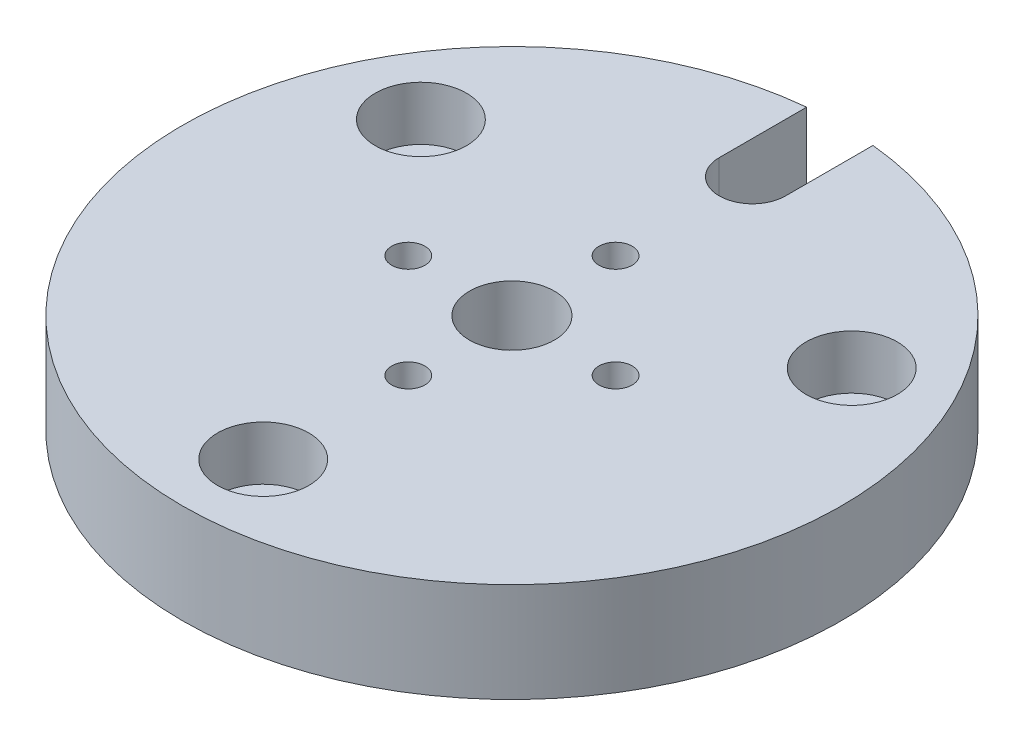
ISO-10303-21;
HEADER;
FILE_DESCRIPTION(('STEP AP214'),'2;1');
FILE_NAME('part.step','',(''),(''),'','','');
FILE_SCHEMA(('AUTOMOTIVE_DESIGN { 1 0 10303 214 1 1 1 1 }'));
ENDSEC;
DATA;
#1=APPLICATION_CONTEXT('core data for automotive mechanical design processes');
#2=APPLICATION_PROTOCOL_DEFINITION('international standard','automotive_design',2000,#1);
#3=PRODUCT_CONTEXT('',#1,'mechanical');
#4=PRODUCT('Part','Part','',(#3));
#5=PRODUCT_RELATED_PRODUCT_CATEGORY('part','',(#4));
#6=PRODUCT_DEFINITION_FORMATION('','',#4);
#7=PRODUCT_DEFINITION_CONTEXT('part definition',#1,'design');
#8=PRODUCT_DEFINITION('design','',#6,#7);
#9=PRODUCT_DEFINITION_SHAPE('','',#8);
#10=(LENGTH_UNIT() NAMED_UNIT(*) SI_UNIT(.MILLI.,.METRE.));
#11=(NAMED_UNIT(*) PLANE_ANGLE_UNIT() SI_UNIT($,.RADIAN.));
#12=(NAMED_UNIT(*) SI_UNIT($,.STERADIAN.) SOLID_ANGLE_UNIT());
#13=UNCERTAINTY_MEASURE_WITH_UNIT(LENGTH_MEASURE(1.E-05),#10,'distance_accuracy_value','');
#14=(GEOMETRIC_REPRESENTATION_CONTEXT(3) GLOBAL_UNCERTAINTY_ASSIGNED_CONTEXT((#13)) GLOBAL_UNIT_ASSIGNED_CONTEXT((#10,
#11,#12)) REPRESENTATION_CONTEXT('',''));
#15=CARTESIAN_POINT('',(0.,0.,0.));
#16=DIRECTION('',(0.,0.,1.));
#17=DIRECTION('',(1.,0.,0.));
#18=AXIS2_PLACEMENT_3D('',#15,#16,#17);
#19=CARTESIAN_POINT('',(0.,26.9919886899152,0.));
#20=DIRECTION('',(0.,1.,0.));
#21=DIRECTION('',(0.,0.,1.));
#22=AXIS2_PLACEMENT_3D('',#19,#20,#21);
#23=CYLINDRICAL_SURFACE('',#22,20.);
#24=CARTESIAN_POINT('',(0.,-6.99999999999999,0.));
#25=DIRECTION('',(0.,1.,0.));
#26=DIRECTION('',(0.,0.,1.));
#27=AXIS2_PLACEMENT_3D('',#24,#25,#26);
#28=CIRCLE('',#27,20.);
#29=CARTESIAN_POINT('',(0.,-6.99999999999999,20.));
#30=VERTEX_POINT('',#29);
#31=EDGE_CURVE('E457',#30,#30,#28,.T.);
#32=ORIENTED_EDGE('',*,*,#31,.T.);
#33=EDGE_LOOP('',(#32));
#34=FACE_BOUND('',#33,.T.);
#35=CARTESIAN_POINT('',(0.,0.,0.));
#36=DIRECTION('',(0.,1.,0.));
#37=DIRECTION('',(0.,0.,1.));
#38=AXIS2_PLACEMENT_3D('',#35,#36,#37);
#39=CIRCLE('',#38,20.);
#40=CARTESIAN_POINT('',(0.,0.,20.));
#41=VERTEX_POINT('',#40);
#42=EDGE_CURVE('E564',#41,#41,#39,.T.);
#43=ORIENTED_EDGE('',*,*,#42,.F.);
#44=EDGE_LOOP('',(#43));
#45=FACE_BOUND('',#44,.T.);
#46=ADVANCED_FACE('F450',(#34,#45),#23,.T.);
#47=CARTESIAN_POINT('',(20.,0.,0.));
#48=DIRECTION('',(0.,1.,0.));
#49=DIRECTION('',(0.,0.,1.));
#50=AXIS2_PLACEMENT_3D('',#47,#48,#49);
#51=PLANE('',#50);
#52=CARTESIAN_POINT('',(0.,0.,30.));
#53=DIRECTION('',(0.,1.,0.));
#54=DIRECTION('',(0.,0.,1.));
#55=AXIS2_PLACEMENT_3D('',#52,#53,#54);
#56=CIRCLE('',#55,3.25);
#57=CARTESIAN_POINT('',(0.,0.,33.25));
#58=VERTEX_POINT('',#57);
#59=EDGE_CURVE('E532',#58,#58,#56,.T.);
#60=ORIENTED_EDGE('',*,*,#59,.T.);
#61=EDGE_LOOP('',(#60));
#62=FACE_BOUND('',#61,.T.);
#63=CARTESIAN_POINT('',(-25.9807621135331,0.,-15.0000000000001));
#64=DIRECTION('',(0.,1.,0.));
#65=DIRECTION('',(0.,0.,1.));
#66=AXIS2_PLACEMENT_3D('',#63,#64,#65);
#67=CIRCLE('',#66,3.25);
#68=CARTESIAN_POINT('',(-25.9807621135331,0.,-11.7500000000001));
#69=VERTEX_POINT('',#68);
#70=EDGE_CURVE('E542',#69,#69,#67,.T.);
#71=ORIENTED_EDGE('',*,*,#70,.T.);
#72=EDGE_LOOP('',(#71));
#73=FACE_BOUND('',#72,.T.);
#74=CARTESIAN_POINT('',(25.9807621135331,0.,-15.0000000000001));
#75=DIRECTION('',(0.,1.,0.));
#76=DIRECTION('',(0.,0.,1.));
#77=AXIS2_PLACEMENT_3D('',#74,#75,#76);
#78=CIRCLE('',#77,3.25);
#79=CARTESIAN_POINT('',(25.9807621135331,0.,-11.7500000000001));
#80=VERTEX_POINT('',#79);
#81=EDGE_CURVE('E552',#80,#80,#78,.T.);
#82=ORIENTED_EDGE('',*,*,#81,.T.);
#83=EDGE_LOOP('',(#82));
#84=FACE_BOUND('',#83,.T.);
#85=CARTESIAN_POINT('',(0.,0.,-29.));
#86=DIRECTION('',(0.,1.,0.));
#87=DIRECTION('',(0.,0.,1.));
#88=AXIS2_PLACEMENT_3D('',#85,#86,#87);
#89=CIRCLE('',#88,4.);
#90=CARTESIAN_POINT('',(-4.,0.,-29.));
#91=VERTEX_POINT('',#90);
#92=CARTESIAN_POINT('',(4.,0.,-29.));
#93=VERTEX_POINT('',#92);
#94=EDGE_CURVE('E498',#91,#93,#89,.T.);
#95=ORIENTED_EDGE('',*,*,#94,.T.);
#96=DIRECTION('',(0.,0.,-1.));
#97=VECTOR('',#96,1.);
#98=CARTESIAN_POINT('',(4.,0.,0.));
#99=LINE('',#98,#97);
#100=CARTESIAN_POINT('',(4.,0.,-39.5482300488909));
#101=VERTEX_POINT('',#100);
#102=EDGE_CURVE('E521',#93,#101,#99,.T.);
#103=ORIENTED_EDGE('',*,*,#102,.T.);
#104=CARTESIAN_POINT('',(0.,0.,0.));
#105=DIRECTION('',(0.,1.,0.));
#106=DIRECTION('',(0.,0.,1.));
#107=AXIS2_PLACEMENT_3D('',#104,#105,#106);
#108=CIRCLE('',#107,39.75);
#109=CARTESIAN_POINT('',(-4.,0.,-39.5482300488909));
#110=VERTEX_POINT('',#109);
#111=EDGE_CURVE('E561',#110,#101,#108,.T.);
#112=ORIENTED_EDGE('',*,*,#111,.F.);
#113=DIRECTION('',(0.,0.,1.));
#114=VECTOR('',#113,1.);
#115=CARTESIAN_POINT('',(-4.,0.,0.));
#116=LINE('',#115,#114);
#117=EDGE_CURVE('E516',#110,#91,#116,.T.);
#118=ORIENTED_EDGE('',*,*,#117,.T.);
#119=EDGE_LOOP('',(#95,#103,#112,#118));
#120=FACE_BOUND('',#119,.T.);
#121=ORIENTED_EDGE('',*,*,#42,.T.);
#122=EDGE_LOOP('',(#121));
#123=FACE_BOUND('',#122,.T.);
#124=ADVANCED_FACE('F591',(#62,#73,#84,#120,#123),#51,.F.);
#125=CARTESIAN_POINT('',(0.,26.9919886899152,0.));
#126=DIRECTION('',(0.,1.,0.));
#127=DIRECTION('',(0.,0.,1.));
#128=AXIS2_PLACEMENT_3D('',#125,#126,#127);
#129=CYLINDRICAL_SURFACE('',#128,39.75);
#130=ORIENTED_EDGE('',*,*,#111,.T.);
#131=DIRECTION('',(0.,1.,0.));
#132=VECTOR('',#131,1.);
#133=CARTESIAN_POINT('',(4.,-8.,-39.5482300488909));
#134=LINE('',#133,#132);
#135=CARTESIAN_POINT('',(4.,12.,-39.5482300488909));
#136=VERTEX_POINT('',#135);
#137=EDGE_CURVE('E472',#101,#136,#134,.T.);
#138=ORIENTED_EDGE('',*,*,#137,.T.);
#139=CARTESIAN_POINT('',(0.,12.,0.));
#140=DIRECTION('',(0.,1.,0.));
#141=DIRECTION('',(0.,0.,1.));
#142=AXIS2_PLACEMENT_3D('',#139,#140,#141);
#143=CIRCLE('',#142,39.75);
#144=CARTESIAN_POINT('',(-4.,12.,-39.5482300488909));
#145=VERTEX_POINT('',#144);
#146=EDGE_CURVE('E559',#145,#136,#143,.T.);
#147=ORIENTED_EDGE('',*,*,#146,.F.);
#148=DIRECTION('',(0.,1.,0.));
#149=VECTOR('',#148,1.);
#150=CARTESIAN_POINT('',(-4.,-8.,-39.5482300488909));
#151=LINE('',#150,#149);
#152=EDGE_CURVE('E464',#110,#145,#151,.T.);
#153=ORIENTED_EDGE('',*,*,#152,.F.);
#154=EDGE_LOOP('',(#130,#138,#147,#153));
#155=FACE_BOUND('',#154,.T.);
#156=ADVANCED_FACE('F595',(#155),#129,.T.);
#157=CARTESIAN_POINT('',(5.125,12.,0.));
#158=DIRECTION('',(0.,-1.,0.));
#159=DIRECTION('',(0.,0.,-1.));
#160=AXIS2_PLACEMENT_3D('',#157,#158,#159);
#161=PLANE('',#160);
#162=CARTESIAN_POINT('',(-12.5,12.,0.));
#163=DIRECTION('',(0.,1.,0.));
#164=DIRECTION('',(0.,0.,-1.));
#165=AXIS2_PLACEMENT_3D('',#162,#163,#164);
#166=CIRCLE('',#165,2.);
#167=CARTESIAN_POINT('',(-12.5,12.,-2.));
#168=VERTEX_POINT('',#167);
#169=EDGE_CURVE('E682',#168,#168,#166,.T.);
#170=ORIENTED_EDGE('',*,*,#169,.F.);
#171=EDGE_LOOP('',(#170));
#172=FACE_BOUND('',#171,.T.);
#173=CARTESIAN_POINT('',(12.5,12.,0.));
#174=DIRECTION('',(0.,1.,0.));
#175=DIRECTION('',(0.,0.,1.));
#176=AXIS2_PLACEMENT_3D('',#173,#174,#175);
#177=CIRCLE('',#176,2.);
#178=CARTESIAN_POINT('',(12.5,12.,2.));
#179=VERTEX_POINT('',#178);
#180=EDGE_CURVE('E675',#179,#179,#177,.T.);
#181=ORIENTED_EDGE('',*,*,#180,.F.);
#182=EDGE_LOOP('',(#181));
#183=FACE_BOUND('',#182,.T.);
#184=CARTESIAN_POINT('',(0.,12.,12.5));
#185=DIRECTION('',(0.,1.,0.));
#186=DIRECTION('',(0.,0.,-1.));
#187=AXIS2_PLACEMENT_3D('',#184,#185,#186);
#188=CIRCLE('',#187,2.);
#189=CARTESIAN_POINT('',(0.,12.,10.5));
#190=VERTEX_POINT('',#189);
#191=EDGE_CURVE('E679',#190,#190,#188,.T.);
#192=ORIENTED_EDGE('',*,*,#191,.F.);
#193=EDGE_LOOP('',(#192));
#194=FACE_BOUND('',#193,.T.);
#195=CARTESIAN_POINT('',(0.,12.,-12.5));
#196=DIRECTION('',(0.,1.,0.));
#197=DIRECTION('',(0.,0.,1.));
#198=AXIS2_PLACEMENT_3D('',#195,#196,#197);
#199=CIRCLE('',#198,2.);
#200=CARTESIAN_POINT('',(0.,12.,-10.5));
#201=VERTEX_POINT('',#200);
#202=EDGE_CURVE('E691',#201,#201,#199,.T.);
#203=ORIENTED_EDGE('',*,*,#202,.F.);
#204=EDGE_LOOP('',(#203));
#205=FACE_BOUND('',#204,.T.);
#206=CARTESIAN_POINT('',(0.,12.,30.));
#207=DIRECTION('',(0.,1.,0.));
#208=DIRECTION('',(0.,0.,1.));
#209=AXIS2_PLACEMENT_3D('',#206,#207,#208);
#210=CIRCLE('',#209,5.49999999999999);
#211=CARTESIAN_POINT('',(0.,12.,35.5));
#212=VERTEX_POINT('',#211);
#213=EDGE_CURVE('E523',#212,#212,#210,.T.);
#214=ORIENTED_EDGE('',*,*,#213,.F.);
#215=EDGE_LOOP('',(#214));
#216=FACE_BOUND('',#215,.T.);
#217=CARTESIAN_POINT('',(-25.9807621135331,12.,-15.0000000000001));
#218=DIRECTION('',(0.,1.,0.));
#219=DIRECTION('',(0.,0.,1.));
#220=AXIS2_PLACEMENT_3D('',#217,#218,#219);
#221=CIRCLE('',#220,5.49999999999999);
#222=CARTESIAN_POINT('',(-25.9807621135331,12.,-9.50000000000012));
#223=VERTEX_POINT('',#222);
#224=EDGE_CURVE('E533',#223,#223,#221,.T.);
#225=ORIENTED_EDGE('',*,*,#224,.F.);
#226=EDGE_LOOP('',(#225));
#227=FACE_BOUND('',#226,.T.);
#228=CARTESIAN_POINT('',(25.9807621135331,12.,-15.0000000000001));
#229=DIRECTION('',(0.,1.,0.));
#230=DIRECTION('',(0.,0.,1.));
#231=AXIS2_PLACEMENT_3D('',#228,#229,#230);
#232=CIRCLE('',#231,5.49999999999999);
#233=CARTESIAN_POINT('',(25.9807621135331,12.,-9.50000000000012));
#234=VERTEX_POINT('',#233);
#235=EDGE_CURVE('E543',#234,#234,#232,.T.);
#236=ORIENTED_EDGE('',*,*,#235,.F.);
#237=EDGE_LOOP('',(#236));
#238=FACE_BOUND('',#237,.T.);
#239=CARTESIAN_POINT('',(0.,12.,0.));
#240=DIRECTION('',(0.,1.,0.));
#241=DIRECTION('',(0.,0.,1.));
#242=AXIS2_PLACEMENT_3D('',#239,#240,#241);
#243=CIRCLE('',#242,5.125);
#244=CARTESIAN_POINT('',(0.,12.,5.125));
#245=VERTEX_POINT('',#244);
#246=EDGE_CURVE('E556',#245,#245,#243,.T.);
#247=ORIENTED_EDGE('',*,*,#246,.F.);
#248=EDGE_LOOP('',(#247));
#249=FACE_BOUND('',#248,.T.);
#250=ORIENTED_EDGE('',*,*,#146,.T.);
#251=DIRECTION('',(0.,0.,-1.));
#252=VECTOR('',#251,1.);
#253=CARTESIAN_POINT('',(4.,12.,-39.5482300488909));
#254=LINE('',#253,#252);
#255=CARTESIAN_POINT('',(4.,12.,-29.));
#256=VERTEX_POINT('',#255);
#257=EDGE_CURVE('E510',#256,#136,#254,.T.);
#258=ORIENTED_EDGE('',*,*,#257,.F.);
#259=CARTESIAN_POINT('',(0.,12.,-29.));
#260=DIRECTION('',(0.,1.,0.));
#261=DIRECTION('',(0.,0.,-1.));
#262=AXIS2_PLACEMENT_3D('',#259,#260,#261);
#263=CIRCLE('',#262,4.);
#264=CARTESIAN_POINT('',(-4.,12.,-29.));
#265=VERTEX_POINT('',#264);
#266=EDGE_CURVE('E495',#265,#256,#263,.T.);
#267=ORIENTED_EDGE('',*,*,#266,.F.);
#268=DIRECTION('',(0.,0.,1.));
#269=VECTOR('',#268,1.);
#270=CARTESIAN_POINT('',(-4.,12.,-39.5482300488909));
#271=LINE('',#270,#269);
#272=EDGE_CURVE('E502',#145,#265,#271,.T.);
#273=ORIENTED_EDGE('',*,*,#272,.F.);
#274=EDGE_LOOP('',(#250,#258,#267,#273));
#275=FACE_BOUND('',#274,.T.);
#276=ADVANCED_FACE('F509',(#172,#183,#194,#205,#216,#227,#238,#249,#275),#161,.F.);
#277=CARTESIAN_POINT('',(0.,26.9919886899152,0.));
#278=DIRECTION('',(0.,1.,0.));
#279=DIRECTION('',(0.,0.,1.));
#280=AXIS2_PLACEMENT_3D('',#277,#278,#279);
#281=CYLINDRICAL_SURFACE('',#280,5.125);
#282=CARTESIAN_POINT('',(0.,-8.,0.));
#283=DIRECTION('',(0.,1.,0.));
#284=DIRECTION('',(0.,0.,1.));
#285=AXIS2_PLACEMENT_3D('',#282,#283,#284);
#286=CIRCLE('',#285,5.125);
#287=CARTESIAN_POINT('',(0.,-8.,5.125));
#288=VERTEX_POINT('',#287);
#289=EDGE_CURVE('E553',#288,#288,#286,.T.);
#290=ORIENTED_EDGE('',*,*,#289,.F.);
#291=EDGE_LOOP('',(#290));
#292=FACE_BOUND('',#291,.T.);
#293=ORIENTED_EDGE('',*,*,#246,.T.);
#294=EDGE_LOOP('',(#293));
#295=FACE_BOUND('',#294,.T.);
#296=ADVANCED_FACE('F607',(#292,#295),#281,.F.);
#297=CARTESIAN_POINT('',(20.,-8.,0.));
#298=DIRECTION('',(0.,1.,0.));
#299=DIRECTION('',(0.,0.,1.));
#300=AXIS2_PLACEMENT_3D('',#297,#298,#299);
#301=PLANE('',#300);
#302=CARTESIAN_POINT('',(0.,-8.,0.));
#303=DIRECTION('',(0.,1.,0.));
#304=DIRECTION('',(0.,0.,1.));
#305=AXIS2_PLACEMENT_3D('',#302,#303,#304);
#306=CIRCLE('',#305,19.4226497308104);
#307=CARTESIAN_POINT('',(0.,-8.,19.4226497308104));
#308=VERTEX_POINT('',#307);
#309=EDGE_CURVE('E11',#308,#308,#306,.F.);
#310=ORIENTED_EDGE('',*,*,#309,.T.);
#311=EDGE_LOOP('',(#310));
#312=FACE_BOUND('',#311,.T.);
#313=CARTESIAN_POINT('',(-12.5,-8.,0.));
#314=DIRECTION('',(0.,1.,0.));
#315=DIRECTION('',(0.,0.,-1.));
#316=AXIS2_PLACEMENT_3D('',#313,#314,#315);
#317=CIRCLE('',#316,2.);
#318=CARTESIAN_POINT('',(-12.5,-8.,-2.));
#319=VERTEX_POINT('',#318);
#320=EDGE_CURVE('E677',#319,#319,#317,.T.);
#321=ORIENTED_EDGE('',*,*,#320,.T.);
#322=EDGE_LOOP('',(#321));
#323=FACE_BOUND('',#322,.T.);
#324=CARTESIAN_POINT('',(12.5,-8.,0.));
#325=DIRECTION('',(0.,1.,0.));
#326=DIRECTION('',(0.,0.,1.));
#327=AXIS2_PLACEMENT_3D('',#324,#325,#326);
#328=CIRCLE('',#327,2.);
#329=CARTESIAN_POINT('',(12.5,-8.,2.));
#330=VERTEX_POINT('',#329);
#331=EDGE_CURVE('E672',#330,#330,#328,.T.);
#332=ORIENTED_EDGE('',*,*,#331,.T.);
#333=EDGE_LOOP('',(#332));
#334=FACE_BOUND('',#333,.T.);
#335=CARTESIAN_POINT('',(0.,-8.,12.5));
#336=DIRECTION('',(0.,1.,0.));
#337=DIRECTION('',(0.,0.,-1.));
#338=AXIS2_PLACEMENT_3D('',#335,#336,#337);
#339=CIRCLE('',#338,2.);
#340=CARTESIAN_POINT('',(0.,-8.,10.5));
#341=VERTEX_POINT('',#340);
#342=EDGE_CURVE('E688',#341,#341,#339,.T.);
#343=ORIENTED_EDGE('',*,*,#342,.T.);
#344=EDGE_LOOP('',(#343));
#345=FACE_BOUND('',#344,.T.);
#346=CARTESIAN_POINT('',(0.,-8.,-12.5));
#347=DIRECTION('',(0.,1.,0.));
#348=DIRECTION('',(0.,0.,1.));
#349=AXIS2_PLACEMENT_3D('',#346,#347,#348);
#350=CIRCLE('',#349,2.);
#351=CARTESIAN_POINT('',(0.,-8.,-10.5));
#352=VERTEX_POINT('',#351);
#353=EDGE_CURVE('E507',#352,#352,#350,.T.);
#354=ORIENTED_EDGE('',*,*,#353,.T.);
#355=EDGE_LOOP('',(#354));
#356=FACE_BOUND('',#355,.T.);
#357=ORIENTED_EDGE('',*,*,#289,.T.);
#358=EDGE_LOOP('',(#357));
#359=FACE_BOUND('',#358,.T.);
#360=ADVANCED_FACE('F611',(#312,#323,#334,#345,#356,#359),#301,.F.);
#361=CARTESIAN_POINT('',(25.9807621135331,12.,-15.0000000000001));
#362=DIRECTION('',(0.,1.,0.));
#363=DIRECTION('',(0.,0.,1.));
#364=AXIS2_PLACEMENT_3D('',#361,#362,#363);
#365=CYLINDRICAL_SURFACE('',#364,3.25);
#366=CARTESIAN_POINT('',(25.9807621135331,5.5,-15.0000000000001));
#367=DIRECTION('',(0.,1.,0.));
#368=DIRECTION('',(0.,0.,1.));
#369=AXIS2_PLACEMENT_3D('',#366,#367,#368);
#370=CIRCLE('',#369,3.25);
#371=CARTESIAN_POINT('',(25.9807621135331,5.5,-11.7500000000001));
#372=VERTEX_POINT('',#371);
#373=EDGE_CURVE('E549',#372,#372,#370,.T.);
#374=ORIENTED_EDGE('',*,*,#373,.T.);
#375=EDGE_LOOP('',(#374));
#376=FACE_BOUND('',#375,.T.);
#377=ORIENTED_EDGE('',*,*,#81,.F.);
#378=EDGE_LOOP('',(#377));
#379=FACE_BOUND('',#378,.T.);
#380=ADVANCED_FACE('F614',(#376,#379),#365,.F.);
#381=CARTESIAN_POINT('',(29.2307621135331,5.5,-15.0000000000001));
#382=DIRECTION('',(0.,-1.,0.));
#383=DIRECTION('',(0.,0.,-1.));
#384=AXIS2_PLACEMENT_3D('',#381,#382,#383);
#385=PLANE('',#384);
#386=ORIENTED_EDGE('',*,*,#373,.F.);
#387=EDGE_LOOP('',(#386));
#388=FACE_BOUND('',#387,.T.);
#389=CARTESIAN_POINT('',(25.9807621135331,5.5,-15.0000000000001));
#390=DIRECTION('',(0.,1.,0.));
#391=DIRECTION('',(0.,0.,1.));
#392=AXIS2_PLACEMENT_3D('',#389,#390,#391);
#393=CIRCLE('',#392,5.49999999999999);
#394=CARTESIAN_POINT('',(25.9807621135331,5.5,-9.50000000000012));
#395=VERTEX_POINT('',#394);
#396=EDGE_CURVE('E546',#395,#395,#393,.T.);
#397=ORIENTED_EDGE('',*,*,#396,.T.);
#398=EDGE_LOOP('',(#397));
#399=FACE_BOUND('',#398,.T.);
#400=ADVANCED_FACE('F618',(#388,#399),#385,.F.);
#401=CARTESIAN_POINT('',(25.9807621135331,12.,-15.0000000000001));
#402=DIRECTION('',(0.,1.,0.));
#403=DIRECTION('',(0.,0.,1.));
#404=AXIS2_PLACEMENT_3D('',#401,#402,#403);
#405=CYLINDRICAL_SURFACE('',#404,5.49999999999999);
#406=ORIENTED_EDGE('',*,*,#396,.F.);
#407=EDGE_LOOP('',(#406));
#408=FACE_BOUND('',#407,.T.);
#409=ORIENTED_EDGE('',*,*,#235,.T.);
#410=EDGE_LOOP('',(#409));
#411=FACE_BOUND('',#410,.T.);
#412=ADVANCED_FACE('F622',(#408,#411),#405,.F.);
#413=CARTESIAN_POINT('',(-25.9807621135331,12.,-15.0000000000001));
#414=DIRECTION('',(0.,1.,0.));
#415=DIRECTION('',(0.,0.,1.));
#416=AXIS2_PLACEMENT_3D('',#413,#414,#415);
#417=CYLINDRICAL_SURFACE('',#416,3.25);
#418=CARTESIAN_POINT('',(-25.9807621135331,5.5,-15.0000000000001));
#419=DIRECTION('',(0.,1.,0.));
#420=DIRECTION('',(0.,0.,1.));
#421=AXIS2_PLACEMENT_3D('',#418,#419,#420);
#422=CIRCLE('',#421,3.25);
#423=CARTESIAN_POINT('',(-25.9807621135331,5.5,-11.7500000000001));
#424=VERTEX_POINT('',#423);
#425=EDGE_CURVE('E539',#424,#424,#422,.T.);
#426=ORIENTED_EDGE('',*,*,#425,.T.);
#427=EDGE_LOOP('',(#426));
#428=FACE_BOUND('',#427,.T.);
#429=ORIENTED_EDGE('',*,*,#70,.F.);
#430=EDGE_LOOP('',(#429));
#431=FACE_BOUND('',#430,.T.);
#432=ADVANCED_FACE('F626',(#428,#431),#417,.F.);
#433=CARTESIAN_POINT('',(-22.7307621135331,5.5,-15.0000000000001));
#434=DIRECTION('',(0.,-1.,0.));
#435=DIRECTION('',(0.,0.,-1.));
#436=AXIS2_PLACEMENT_3D('',#433,#434,#435);
#437=PLANE('',#436);
#438=ORIENTED_EDGE('',*,*,#425,.F.);
#439=EDGE_LOOP('',(#438));
#440=FACE_BOUND('',#439,.T.);
#441=CARTESIAN_POINT('',(-25.9807621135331,5.5,-15.0000000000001));
#442=DIRECTION('',(0.,1.,0.));
#443=DIRECTION('',(0.,0.,1.));
#444=AXIS2_PLACEMENT_3D('',#441,#442,#443);
#445=CIRCLE('',#444,5.49999999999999);
#446=CARTESIAN_POINT('',(-25.9807621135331,5.5,-9.50000000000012));
#447=VERTEX_POINT('',#446);
#448=EDGE_CURVE('E536',#447,#447,#445,.T.);
#449=ORIENTED_EDGE('',*,*,#448,.T.);
#450=EDGE_LOOP('',(#449));
#451=FACE_BOUND('',#450,.T.);
#452=ADVANCED_FACE('F630',(#440,#451),#437,.F.);
#453=CARTESIAN_POINT('',(-25.9807621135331,12.,-15.0000000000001));
#454=DIRECTION('',(0.,1.,0.));
#455=DIRECTION('',(0.,0.,1.));
#456=AXIS2_PLACEMENT_3D('',#453,#454,#455);
#457=CYLINDRICAL_SURFACE('',#456,5.49999999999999);
#458=ORIENTED_EDGE('',*,*,#448,.F.);
#459=EDGE_LOOP('',(#458));
#460=FACE_BOUND('',#459,.T.);
#461=ORIENTED_EDGE('',*,*,#224,.T.);
#462=EDGE_LOOP('',(#461));
#463=FACE_BOUND('',#462,.T.);
#464=ADVANCED_FACE('F634',(#460,#463),#457,.F.);
#465=CARTESIAN_POINT('',(0.,12.,30.));
#466=DIRECTION('',(0.,1.,0.));
#467=DIRECTION('',(0.,0.,1.));
#468=AXIS2_PLACEMENT_3D('',#465,#466,#467);
#469=CYLINDRICAL_SURFACE('',#468,3.25);
#470=CARTESIAN_POINT('',(0.,5.5,30.));
#471=DIRECTION('',(0.,1.,0.));
#472=DIRECTION('',(0.,0.,1.));
#473=AXIS2_PLACEMENT_3D('',#470,#471,#472);
#474=CIRCLE('',#473,3.25);
#475=CARTESIAN_POINT('',(0.,5.5,33.25));
#476=VERTEX_POINT('',#475);
#477=EDGE_CURVE('E529',#476,#476,#474,.T.);
#478=ORIENTED_EDGE('',*,*,#477,.T.);
#479=EDGE_LOOP('',(#478));
#480=FACE_BOUND('',#479,.T.);
#481=ORIENTED_EDGE('',*,*,#59,.F.);
#482=EDGE_LOOP('',(#481));
#483=FACE_BOUND('',#482,.T.);
#484=ADVANCED_FACE('F638',(#480,#483),#469,.F.);
#485=CARTESIAN_POINT('',(3.25,5.5,30.));
#486=DIRECTION('',(0.,-1.,0.));
#487=DIRECTION('',(0.,0.,-1.));
#488=AXIS2_PLACEMENT_3D('',#485,#486,#487);
#489=PLANE('',#488);
#490=ORIENTED_EDGE('',*,*,#477,.F.);
#491=EDGE_LOOP('',(#490));
#492=FACE_BOUND('',#491,.T.);
#493=CARTESIAN_POINT('',(0.,5.5,30.));
#494=DIRECTION('',(0.,1.,0.));
#495=DIRECTION('',(0.,0.,1.));
#496=AXIS2_PLACEMENT_3D('',#493,#494,#495);
#497=CIRCLE('',#496,5.5);
#498=CARTESIAN_POINT('',(0.,5.5,35.5));
#499=VERTEX_POINT('',#498);
#500=EDGE_CURVE('E526',#499,#499,#497,.T.);
#501=ORIENTED_EDGE('',*,*,#500,.T.);
#502=EDGE_LOOP('',(#501));
#503=FACE_BOUND('',#502,.T.);
#504=ADVANCED_FACE('F642',(#492,#503),#489,.F.);
#505=CARTESIAN_POINT('',(0.,12.,30.));
#506=DIRECTION('',(0.,1.,0.));
#507=DIRECTION('',(0.,0.,1.));
#508=AXIS2_PLACEMENT_3D('',#505,#506,#507);
#509=CYLINDRICAL_SURFACE('',#508,5.5);
#510=ORIENTED_EDGE('',*,*,#500,.F.);
#511=EDGE_LOOP('',(#510));
#512=FACE_BOUND('',#511,.T.);
#513=ORIENTED_EDGE('',*,*,#213,.T.);
#514=EDGE_LOOP('',(#513));
#515=FACE_BOUND('',#514,.T.);
#516=ADVANCED_FACE('F646',(#512,#515),#509,.F.);
#517=CARTESIAN_POINT('',(4.,-8.,-39.5482300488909));
#518=DIRECTION('',(1.,0.,0.));
#519=DIRECTION('',(0.,0.,-1.));
#520=AXIS2_PLACEMENT_3D('',#517,#518,#519);
#521=PLANE('',#520);
#522=DIRECTION('',(0.,1.,0.));
#523=VECTOR('',#522,1.);
#524=CARTESIAN_POINT('',(4.,-8.,-29.));
#525=LINE('',#524,#523);
#526=EDGE_CURVE('E500',#93,#256,#525,.T.);
#527=ORIENTED_EDGE('',*,*,#526,.T.);
#528=ORIENTED_EDGE('',*,*,#257,.T.);
#529=ORIENTED_EDGE('',*,*,#137,.F.);
#530=ORIENTED_EDGE('',*,*,#102,.F.);
#531=EDGE_LOOP('',(#527,#528,#529,#530));
#532=FACE_BOUND('',#531,.T.);
#533=ADVANCED_FACE('F649',(#532),#521,.F.);
#534=CARTESIAN_POINT('',(0.,-8.,-29.));
#535=DIRECTION('',(0.,1.,0.));
#536=DIRECTION('',(0.,0.,1.));
#537=AXIS2_PLACEMENT_3D('',#534,#535,#536);
#538=CYLINDRICAL_SURFACE('',#537,4.);
#539=DIRECTION('',(0.,1.,0.));
#540=VECTOR('',#539,1.);
#541=CARTESIAN_POINT('',(-4.,-8.,-29.));
#542=LINE('',#541,#540);
#543=EDGE_CURVE('E491',#91,#265,#542,.T.);
#544=ORIENTED_EDGE('',*,*,#543,.T.);
#545=ORIENTED_EDGE('',*,*,#266,.T.);
#546=ORIENTED_EDGE('',*,*,#526,.F.);
#547=ORIENTED_EDGE('',*,*,#94,.F.);
#548=EDGE_LOOP('',(#544,#545,#546,#547));
#549=FACE_BOUND('',#548,.T.);
#550=ADVANCED_FACE('F492',(#549),#538,.F.);
#551=CARTESIAN_POINT('',(-4.,-8.,-39.5482300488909));
#552=DIRECTION('',(-1.,0.,0.));
#553=DIRECTION('',(0.,0.,1.));
#554=AXIS2_PLACEMENT_3D('',#551,#552,#553);
#555=PLANE('',#554);
#556=ORIENTED_EDGE('',*,*,#152,.T.);
#557=ORIENTED_EDGE('',*,*,#272,.T.);
#558=ORIENTED_EDGE('',*,*,#543,.F.);
#559=ORIENTED_EDGE('',*,*,#117,.F.);
#560=EDGE_LOOP('',(#556,#557,#558,#559));
#561=FACE_BOUND('',#560,.T.);
#562=ADVANCED_FACE('F503',(#561),#555,.F.);
#563=CARTESIAN_POINT('',(0.,-8.,-12.5));
#564=DIRECTION('',(0.,1.,0.));
#565=DIRECTION('',(0.,0.,1.));
#566=AXIS2_PLACEMENT_3D('',#563,#564,#565);
#567=CYLINDRICAL_SURFACE('',#566,2.);
#568=ORIENTED_EDGE('',*,*,#353,.F.);
#569=EDGE_LOOP('',(#568));
#570=FACE_BOUND('',#569,.T.);
#571=ORIENTED_EDGE('',*,*,#202,.T.);
#572=EDGE_LOOP('',(#571));
#573=FACE_BOUND('',#572,.T.);
#574=ADVANCED_FACE('F653',(#570,#573),#567,.F.);
#575=CARTESIAN_POINT('',(0.,-8.,12.5));
#576=DIRECTION('',(0.,1.,0.));
#577=DIRECTION('',(0.,0.,1.));
#578=AXIS2_PLACEMENT_3D('',#575,#576,#577);
#579=CYLINDRICAL_SURFACE('',#578,2.);
#580=ORIENTED_EDGE('',*,*,#342,.F.);
#581=EDGE_LOOP('',(#580));
#582=FACE_BOUND('',#581,.T.);
#583=ORIENTED_EDGE('',*,*,#191,.T.);
#584=EDGE_LOOP('',(#583));
#585=FACE_BOUND('',#584,.T.);
#586=ADVANCED_FACE('F660',(#582,#585),#579,.F.);
#587=CARTESIAN_POINT('',(12.5,-8.,0.));
#588=DIRECTION('',(0.,1.,0.));
#589=DIRECTION('',(0.,0.,1.));
#590=AXIS2_PLACEMENT_3D('',#587,#588,#589);
#591=CYLINDRICAL_SURFACE('',#590,2.);
#592=ORIENTED_EDGE('',*,*,#331,.F.);
#593=EDGE_LOOP('',(#592));
#594=FACE_BOUND('',#593,.T.);
#595=ORIENTED_EDGE('',*,*,#180,.T.);
#596=EDGE_LOOP('',(#595));
#597=FACE_BOUND('',#596,.T.);
#598=ADVANCED_FACE('F586',(#594,#597),#591,.F.);
#599=CARTESIAN_POINT('',(-12.5,-8.,0.));
#600=DIRECTION('',(0.,1.,0.));
#601=DIRECTION('',(0.,0.,1.));
#602=AXIS2_PLACEMENT_3D('',#599,#600,#601);
#603=CYLINDRICAL_SURFACE('',#602,2.);
#604=ORIENTED_EDGE('',*,*,#320,.F.);
#605=EDGE_LOOP('',(#604));
#606=FACE_BOUND('',#605,.T.);
#607=ORIENTED_EDGE('',*,*,#169,.T.);
#608=EDGE_LOOP('',(#607));
#609=FACE_BOUND('',#608,.T.);
#610=ADVANCED_FACE('F579',(#606,#609),#603,.F.);
#611=CARTESIAN_POINT('',(0.,-6.99999999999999,0.));
#612=DIRECTION('',(0.,1.,0.));
#613=DIRECTION('',(0.,0.,1.));
#614=AXIS2_PLACEMENT_3D('',#611,#612,#613);
#615=CONICAL_SURFACE('',#614,20.,0.523598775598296);
#616=ORIENTED_EDGE('',*,*,#309,.F.);
#617=EDGE_LOOP('',(#616));
#618=FACE_BOUND('',#617,.T.);
#619=ORIENTED_EDGE('',*,*,#31,.F.);
#620=EDGE_LOOP('',(#619));
#621=FACE_BOUND('',#620,.T.);
#622=ADVANCED_FACE('F577',(#618,#621),#615,.T.);
#623=CLOSED_SHELL('',(#46,#124,#156,#276,#296,#360,#380,#400,#412,#432,#452,#464,#484,#504,#516,
#533,#550,#562,#574,#586,#598,#610,#622));
#624=MANIFOLD_SOLID_BREP('B2',#623);
#625=ADVANCED_BREP_SHAPE_REPRESENTATION('',(#18,#624),#14);
#626=SHAPE_DEFINITION_REPRESENTATION(#9,#625);
ENDSEC;
END-ISO-10303-21;
